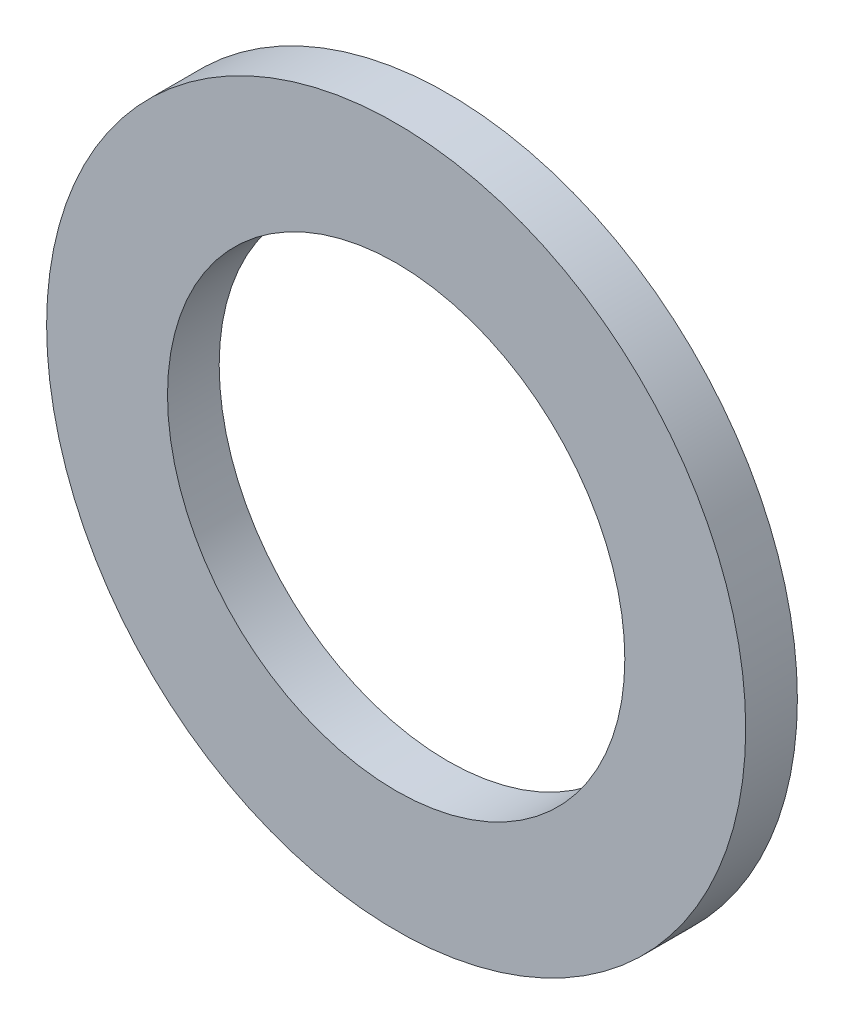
ISO-10303-21;
HEADER;
FILE_DESCRIPTION(('STEP AP214'),'2;1');
FILE_NAME('part.step','',(''),(''),'','','');
FILE_SCHEMA(('AUTOMOTIVE_DESIGN { 1 0 10303 214 1 1 1 1 }'));
ENDSEC;
DATA;
#1=APPLICATION_CONTEXT('core data for automotive mechanical design processes');
#2=APPLICATION_PROTOCOL_DEFINITION('international standard','automotive_design',2000,#1);
#3=PRODUCT_CONTEXT('',#1,'mechanical');
#4=PRODUCT('Part','Part','',(#3));
#5=PRODUCT_RELATED_PRODUCT_CATEGORY('part','',(#4));
#6=PRODUCT_DEFINITION_FORMATION('','',#4);
#7=PRODUCT_DEFINITION_CONTEXT('part definition',#1,'design');
#8=PRODUCT_DEFINITION('design','',#6,#7);
#9=PRODUCT_DEFINITION_SHAPE('','',#8);
#10=(LENGTH_UNIT() NAMED_UNIT(*) SI_UNIT(.MILLI.,.METRE.));
#11=(NAMED_UNIT(*) PLANE_ANGLE_UNIT() SI_UNIT($,.RADIAN.));
#12=(NAMED_UNIT(*) SI_UNIT($,.STERADIAN.) SOLID_ANGLE_UNIT());
#13=UNCERTAINTY_MEASURE_WITH_UNIT(LENGTH_MEASURE(1.E-05),#10,'distance_accuracy_value','');
#14=(GEOMETRIC_REPRESENTATION_CONTEXT(3) GLOBAL_UNCERTAINTY_ASSIGNED_CONTEXT((#13)) GLOBAL_UNIT_ASSIGNED_CONTEXT((#10,
#11,#12)) REPRESENTATION_CONTEXT('',''));
#15=CARTESIAN_POINT('',(0.,0.,0.));
#16=DIRECTION('',(0.,0.,1.));
#17=DIRECTION('',(1.,0.,0.));
#18=AXIS2_PLACEMENT_3D('',#15,#16,#17);
#19=CARTESIAN_POINT('',(9.46847857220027,-4.90502847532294,1.524));
#20=DIRECTION('',(0.,0.,1.));
#21=DIRECTION('',(1.,0.,0.));
#22=AXIS2_PLACEMENT_3D('',#19,#20,#21);
#23=PLANE('',#22);
#24=CARTESIAN_POINT('',(9.46847857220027,-4.90502847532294,1.524));
#25=DIRECTION('',(0.,0.,1.));
#26=DIRECTION('',(1.,0.,0.));
#27=AXIS2_PLACEMENT_3D('',#24,#25,#26);
#28=CIRCLE('',#27,10.3089848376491);
#29=CARTESIAN_POINT('',(-0.840506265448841,-4.90502847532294,1.524));
#30=VERTEX_POINT('',#29);
#31=EDGE_CURVE('E10',#30,#30,#28,.T.);
#32=ORIENTED_EDGE('',*,*,#31,.T.);
#33=EDGE_LOOP('',(#32));
#34=FACE_BOUND('',#33,.T.);
#35=CARTESIAN_POINT('',(9.46847857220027,-4.90502847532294,1.524));
#36=DIRECTION('',(0.,0.,1.));
#37=DIRECTION('',(1.,0.,0.));
#38=AXIS2_PLACEMENT_3D('',#35,#36,#37);
#39=CIRCLE('',#38,6.7437);
#40=CARTESIAN_POINT('',(2.72477857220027,-4.90502847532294,1.524));
#41=VERTEX_POINT('',#40);
#42=EDGE_CURVE('E43',#41,#41,#39,.T.);
#43=ORIENTED_EDGE('',*,*,#42,.F.);
#44=EDGE_LOOP('',(#43));
#45=FACE_BOUND('',#44,.T.);
#46=ADVANCED_FACE('F32',(#34,#45),#23,.T.);
#47=CARTESIAN_POINT('',(9.46847857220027,-4.90502847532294,0.));
#48=DIRECTION('',(0.,0.,1.));
#49=DIRECTION('',(1.,0.,0.));
#50=AXIS2_PLACEMENT_3D('',#47,#48,#49);
#51=PLANE('',#50);
#52=CARTESIAN_POINT('',(9.46847857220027,-4.90502847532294,0.));
#53=DIRECTION('',(0.,0.,1.));
#54=DIRECTION('',(1.,0.,0.));
#55=AXIS2_PLACEMENT_3D('',#52,#53,#54);
#56=CIRCLE('',#55,10.3089848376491);
#57=CARTESIAN_POINT('',(-0.840506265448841,-4.90502847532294,0.));
#58=VERTEX_POINT('',#57);
#59=EDGE_CURVE('E36',#58,#58,#56,.T.);
#60=ORIENTED_EDGE('',*,*,#59,.F.);
#61=EDGE_LOOP('',(#60));
#62=FACE_BOUND('',#61,.T.);
#63=CARTESIAN_POINT('',(9.46847857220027,-4.90502847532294,0.));
#64=DIRECTION('',(0.,0.,1.));
#65=DIRECTION('',(1.,0.,0.));
#66=AXIS2_PLACEMENT_3D('',#63,#64,#65);
#67=CIRCLE('',#66,6.7437);
#68=CARTESIAN_POINT('',(2.72477857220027,-4.90502847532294,0.));
#69=VERTEX_POINT('',#68);
#70=EDGE_CURVE('E45',#69,#69,#67,.T.);
#71=ORIENTED_EDGE('',*,*,#70,.T.);
#72=EDGE_LOOP('',(#71));
#73=FACE_BOUND('',#72,.T.);
#74=ADVANCED_FACE('F55',(#62,#73),#51,.F.);
#75=CARTESIAN_POINT('',(9.46847857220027,-4.90502847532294,1.524));
#76=DIRECTION('',(0.,0.,-1.));
#77=DIRECTION('',(-1.,0.,0.));
#78=AXIS2_PLACEMENT_3D('',#75,#76,#77);
#79=CYLINDRICAL_SURFACE('',#78,10.3089848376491);
#80=CARTESIAN_POINT('',(-0.840506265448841,-4.90502847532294,1.524));
#81=CARTESIAN_POINT('',(-0.840506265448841,-4.90502847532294,1.508125));
#82=CARTESIAN_POINT('',(-0.840506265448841,-4.90502847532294,1.49225));
#83=CARTESIAN_POINT('',(-0.840506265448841,-4.90502847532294,1.4605));
#84=CARTESIAN_POINT('',(-0.840506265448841,-4.90502847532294,1.444625));
#85=CARTESIAN_POINT('',(-0.840506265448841,-4.90502847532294,1.412875));
#86=CARTESIAN_POINT('',(-0.840506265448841,-4.90502847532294,1.397));
#87=CARTESIAN_POINT('',(-0.840506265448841,-4.90502847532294,1.36525));
#88=CARTESIAN_POINT('',(-0.840506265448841,-4.90502847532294,1.349375));
#89=CARTESIAN_POINT('',(-0.840506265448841,-4.90502847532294,1.317625));
#90=CARTESIAN_POINT('',(-0.840506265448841,-4.90502847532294,1.30175));
#91=CARTESIAN_POINT('',(-0.840506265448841,-4.90502847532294,1.27));
#92=CARTESIAN_POINT('',(-0.840506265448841,-4.90502847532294,1.254125));
#93=CARTESIAN_POINT('',(-0.840506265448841,-4.90502847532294,1.222375));
#94=CARTESIAN_POINT('',(-0.840506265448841,-4.90502847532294,1.2065));
#95=CARTESIAN_POINT('',(-0.840506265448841,-4.90502847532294,1.17475));
#96=CARTESIAN_POINT('',(-0.840506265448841,-4.90502847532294,1.158875));
#97=CARTESIAN_POINT('',(-0.840506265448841,-4.90502847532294,1.127125));
#98=CARTESIAN_POINT('',(-0.840506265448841,-4.90502847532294,1.11125));
#99=CARTESIAN_POINT('',(-0.840506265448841,-4.90502847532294,1.0795));
#100=CARTESIAN_POINT('',(-0.840506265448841,-4.90502847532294,1.063625));
#101=CARTESIAN_POINT('',(-0.840506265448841,-4.90502847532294,1.031875));
#102=CARTESIAN_POINT('',(-0.840506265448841,-4.90502847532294,1.016));
#103=CARTESIAN_POINT('',(-0.840506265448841,-4.90502847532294,0.98425));
#104=CARTESIAN_POINT('',(-0.840506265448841,-4.90502847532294,0.968375));
#105=CARTESIAN_POINT('',(-0.840506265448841,-4.90502847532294,0.936625));
#106=CARTESIAN_POINT('',(-0.840506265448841,-4.90502847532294,0.92075));
#107=CARTESIAN_POINT('',(-0.840506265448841,-4.90502847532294,0.889));
#108=CARTESIAN_POINT('',(-0.840506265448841,-4.90502847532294,0.873125));
#109=CARTESIAN_POINT('',(-0.840506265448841,-4.90502847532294,0.841375));
#110=CARTESIAN_POINT('',(-0.840506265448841,-4.90502847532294,0.8255));
#111=CARTESIAN_POINT('',(-0.840506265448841,-4.90502847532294,0.79375));
#112=CARTESIAN_POINT('',(-0.840506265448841,-4.90502847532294,0.777875));
#113=CARTESIAN_POINT('',(-0.840506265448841,-4.90502847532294,0.746125));
#114=CARTESIAN_POINT('',(-0.840506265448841,-4.90502847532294,0.73025));
#115=CARTESIAN_POINT('',(-0.840506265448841,-4.90502847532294,0.6985));
#116=CARTESIAN_POINT('',(-0.840506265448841,-4.90502847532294,0.682625));
#117=CARTESIAN_POINT('',(-0.840506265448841,-4.90502847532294,0.650875));
#118=CARTESIAN_POINT('',(-0.840506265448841,-4.90502847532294,0.635));
#119=CARTESIAN_POINT('',(-0.840506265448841,-4.90502847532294,0.60325));
#120=CARTESIAN_POINT('',(-0.840506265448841,-4.90502847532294,0.587375));
#121=CARTESIAN_POINT('',(-0.840506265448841,-4.90502847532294,0.555625));
#122=CARTESIAN_POINT('',(-0.840506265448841,-4.90502847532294,0.53975));
#123=CARTESIAN_POINT('',(-0.840506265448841,-4.90502847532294,0.508));
#124=CARTESIAN_POINT('',(-0.840506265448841,-4.90502847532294,0.492125));
#125=CARTESIAN_POINT('',(-0.840506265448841,-4.90502847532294,0.460375));
#126=CARTESIAN_POINT('',(-0.840506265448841,-4.90502847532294,0.4445));
#127=CARTESIAN_POINT('',(-0.840506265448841,-4.90502847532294,0.41275));
#128=CARTESIAN_POINT('',(-0.840506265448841,-4.90502847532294,0.396875));
#129=CARTESIAN_POINT('',(-0.840506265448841,-4.90502847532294,0.365125));
#130=CARTESIAN_POINT('',(-0.840506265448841,-4.90502847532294,0.34925));
#131=CARTESIAN_POINT('',(-0.840506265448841,-4.90502847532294,0.3175));
#132=CARTESIAN_POINT('',(-0.840506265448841,-4.90502847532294,0.301625));
#133=CARTESIAN_POINT('',(-0.840506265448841,-4.90502847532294,0.269875));
#134=CARTESIAN_POINT('',(-0.840506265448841,-4.90502847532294,0.254));
#135=CARTESIAN_POINT('',(-0.840506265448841,-4.90502847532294,0.22225));
#136=CARTESIAN_POINT('',(-0.840506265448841,-4.90502847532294,0.206375));
#137=CARTESIAN_POINT('',(-0.840506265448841,-4.90502847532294,0.174625));
#138=CARTESIAN_POINT('',(-0.840506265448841,-4.90502847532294,0.15875));
#139=CARTESIAN_POINT('',(-0.840506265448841,-4.90502847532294,0.127));
#140=CARTESIAN_POINT('',(-0.840506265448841,-4.90502847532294,0.111125));
#141=CARTESIAN_POINT('',(-0.840506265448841,-4.90502847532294,0.079375));
#142=CARTESIAN_POINT('',(-0.840506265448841,-4.90502847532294,0.0635));
#143=CARTESIAN_POINT('',(-0.840506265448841,-4.90502847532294,0.0317499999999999));
#144=CARTESIAN_POINT('',(-0.840506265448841,-4.90502847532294,0.015875));
#145=CARTESIAN_POINT('',(-0.840506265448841,-4.90502847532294,0.));
#146=B_SPLINE_CURVE_WITH_KNOTS('',3,(#80,#81,#82,#83,#84,#85,#86,#87,#88,#89,#90,#91,#92,#93,
#94,#95,#96,#97,#98,#99,#100,#101,#102,#103,#104,#105,#106,#107,#108,#109,#110,#111,#112,#113,
#114,#115,#116,#117,#118,#119,#120,#121,#122,#123,#124,#125,#126,#127,#128,#129,#130,#131,#132,
#133,#134,#135,#136,#137,#138,#139,#140,#141,#142,#143,#144,#145),.UNSPECIFIED.,.F.,.F.,(4,2,2,
2,2,2,2,2,2,2,2,2,2,2,2,2,2,2,2,2,2,2,2,2,2,2,2,2,2,2,2,2,4),(0.,0.0476249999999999,
0.0952499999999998,0.142875,0.1905,0.238125,0.28575,0.333375,0.381,0.428625,0.47625,0.523875,
0.5715,0.619125,0.66675,0.714375,0.762,0.809625,0.85725,0.904875,0.9525,1.000125,1.04775,
1.095375,1.143,1.190625,1.23825,1.285875,1.3335,1.381125,1.42875,1.476375,1.524),.UNSPECIFIED.);
#147=EDGE_CURVE('BSEAM34',#30,#58,#146,.T.);
#148=ORIENTED_EDGE('',*,*,#31,.F.);
#149=ORIENTED_EDGE('',*,*,#59,.T.);
#150=ORIENTED_EDGE('',*,*,#147,.T.);
#151=ORIENTED_EDGE('',*,*,#147,.F.);
#152=EDGE_LOOP('',(#148,#150,#149,#151));
#153=FACE_BOUND('',#152,.T.);
#154=ADVANCED_FACE('F34',(#153),#79,.T.);
#155=CARTESIAN_POINT('',(9.46847857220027,-4.90502847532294,1.524));
#156=DIRECTION('',(0.,0.,-1.));
#157=DIRECTION('',(-1.,0.,0.));
#158=AXIS2_PLACEMENT_3D('',#155,#156,#157);
#159=CYLINDRICAL_SURFACE('',#158,6.7437);
#160=CARTESIAN_POINT('',(2.72477857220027,-4.90502847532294,1.524));
#161=CARTESIAN_POINT('',(2.72477857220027,-4.90502847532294,1.508125));
#162=CARTESIAN_POINT('',(2.72477857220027,-4.90502847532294,1.49225));
#163=CARTESIAN_POINT('',(2.72477857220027,-4.90502847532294,1.4605));
#164=CARTESIAN_POINT('',(2.72477857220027,-4.90502847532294,1.444625));
#165=CARTESIAN_POINT('',(2.72477857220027,-4.90502847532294,1.412875));
#166=CARTESIAN_POINT('',(2.72477857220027,-4.90502847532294,1.397));
#167=CARTESIAN_POINT('',(2.72477857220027,-4.90502847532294,1.36525));
#168=CARTESIAN_POINT('',(2.72477857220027,-4.90502847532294,1.349375));
#169=CARTESIAN_POINT('',(2.72477857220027,-4.90502847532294,1.317625));
#170=CARTESIAN_POINT('',(2.72477857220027,-4.90502847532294,1.30175));
#171=CARTESIAN_POINT('',(2.72477857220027,-4.90502847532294,1.27));
#172=CARTESIAN_POINT('',(2.72477857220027,-4.90502847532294,1.254125));
#173=CARTESIAN_POINT('',(2.72477857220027,-4.90502847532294,1.222375));
#174=CARTESIAN_POINT('',(2.72477857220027,-4.90502847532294,1.2065));
#175=CARTESIAN_POINT('',(2.72477857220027,-4.90502847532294,1.17475));
#176=CARTESIAN_POINT('',(2.72477857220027,-4.90502847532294,1.158875));
#177=CARTESIAN_POINT('',(2.72477857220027,-4.90502847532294,1.127125));
#178=CARTESIAN_POINT('',(2.72477857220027,-4.90502847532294,1.11125));
#179=CARTESIAN_POINT('',(2.72477857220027,-4.90502847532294,1.0795));
#180=CARTESIAN_POINT('',(2.72477857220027,-4.90502847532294,1.063625));
#181=CARTESIAN_POINT('',(2.72477857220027,-4.90502847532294,1.031875));
#182=CARTESIAN_POINT('',(2.72477857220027,-4.90502847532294,1.016));
#183=CARTESIAN_POINT('',(2.72477857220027,-4.90502847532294,0.98425));
#184=CARTESIAN_POINT('',(2.72477857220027,-4.90502847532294,0.968375));
#185=CARTESIAN_POINT('',(2.72477857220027,-4.90502847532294,0.936625));
#186=CARTESIAN_POINT('',(2.72477857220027,-4.90502847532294,0.92075));
#187=CARTESIAN_POINT('',(2.72477857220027,-4.90502847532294,0.889));
#188=CARTESIAN_POINT('',(2.72477857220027,-4.90502847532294,0.873125));
#189=CARTESIAN_POINT('',(2.72477857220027,-4.90502847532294,0.841375));
#190=CARTESIAN_POINT('',(2.72477857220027,-4.90502847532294,0.8255));
#191=CARTESIAN_POINT('',(2.72477857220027,-4.90502847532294,0.79375));
#192=CARTESIAN_POINT('',(2.72477857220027,-4.90502847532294,0.777875));
#193=CARTESIAN_POINT('',(2.72477857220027,-4.90502847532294,0.746125));
#194=CARTESIAN_POINT('',(2.72477857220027,-4.90502847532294,0.73025));
#195=CARTESIAN_POINT('',(2.72477857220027,-4.90502847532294,0.6985));
#196=CARTESIAN_POINT('',(2.72477857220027,-4.90502847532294,0.682625));
#197=CARTESIAN_POINT('',(2.72477857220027,-4.90502847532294,0.650875));
#198=CARTESIAN_POINT('',(2.72477857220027,-4.90502847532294,0.635));
#199=CARTESIAN_POINT('',(2.72477857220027,-4.90502847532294,0.60325));
#200=CARTESIAN_POINT('',(2.72477857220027,-4.90502847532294,0.587375));
#201=CARTESIAN_POINT('',(2.72477857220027,-4.90502847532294,0.555625));
#202=CARTESIAN_POINT('',(2.72477857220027,-4.90502847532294,0.53975));
#203=CARTESIAN_POINT('',(2.72477857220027,-4.90502847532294,0.508));
#204=CARTESIAN_POINT('',(2.72477857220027,-4.90502847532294,0.492125));
#205=CARTESIAN_POINT('',(2.72477857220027,-4.90502847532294,0.460375));
#206=CARTESIAN_POINT('',(2.72477857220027,-4.90502847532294,0.4445));
#207=CARTESIAN_POINT('',(2.72477857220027,-4.90502847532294,0.41275));
#208=CARTESIAN_POINT('',(2.72477857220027,-4.90502847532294,0.396875));
#209=CARTESIAN_POINT('',(2.72477857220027,-4.90502847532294,0.365125));
#210=CARTESIAN_POINT('',(2.72477857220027,-4.90502847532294,0.34925));
#211=CARTESIAN_POINT('',(2.72477857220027,-4.90502847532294,0.3175));
#212=CARTESIAN_POINT('',(2.72477857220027,-4.90502847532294,0.301625));
#213=CARTESIAN_POINT('',(2.72477857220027,-4.90502847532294,0.269875));
#214=CARTESIAN_POINT('',(2.72477857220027,-4.90502847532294,0.254));
#215=CARTESIAN_POINT('',(2.72477857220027,-4.90502847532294,0.22225));
#216=CARTESIAN_POINT('',(2.72477857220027,-4.90502847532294,0.206375));
#217=CARTESIAN_POINT('',(2.72477857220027,-4.90502847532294,0.174625));
#218=CARTESIAN_POINT('',(2.72477857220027,-4.90502847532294,0.15875));
#219=CARTESIAN_POINT('',(2.72477857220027,-4.90502847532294,0.127));
#220=CARTESIAN_POINT('',(2.72477857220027,-4.90502847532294,0.111125));
#221=CARTESIAN_POINT('',(2.72477857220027,-4.90502847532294,0.079375));
#222=CARTESIAN_POINT('',(2.72477857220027,-4.90502847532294,0.0635));
#223=CARTESIAN_POINT('',(2.72477857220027,-4.90502847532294,0.0317499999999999));
#224=CARTESIAN_POINT('',(2.72477857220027,-4.90502847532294,0.015875));
#225=CARTESIAN_POINT('',(2.72477857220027,-4.90502847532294,0.));
#226=B_SPLINE_CURVE_WITH_KNOTS('',3,(#160,#161,#162,#163,#164,#165,#166,#167,#168,#169,#170,
#171,#172,#173,#174,#175,#176,#177,#178,#179,#180,#181,#182,#183,#184,#185,#186,#187,#188,#189,
#190,#191,#192,#193,#194,#195,#196,#197,#198,#199,#200,#201,#202,#203,#204,#205,#206,#207,#208,
#209,#210,#211,#212,#213,#214,#215,#216,#217,#218,#219,#220,#221,#222,#223,#224,#225),
.UNSPECIFIED.,.F.,.F.,(4,2,2,2,2,2,2,2,2,2,2,2,2,2,2,2,2,2,2,2,2,2,2,2,2,2,2,2,2,2,2,2,4),(0.,
0.0476249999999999,0.0952499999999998,0.142875,0.1905,0.238125,0.28575,0.333375,0.381,0.428625,
0.47625,0.523875,0.5715,0.619125,0.66675,0.714375,0.762,0.809625,0.85725,0.904875,0.9525,
1.000125,1.04775,1.095375,1.143,1.190625,1.23825,1.285875,1.3335,1.381125,1.42875,1.476375,
1.524),.UNSPECIFIED.);
#227=EDGE_CURVE('BSEAM51',#41,#69,#226,.T.);
#228=ORIENTED_EDGE('',*,*,#42,.T.);
#229=ORIENTED_EDGE('',*,*,#70,.F.);
#230=ORIENTED_EDGE('',*,*,#227,.T.);
#231=ORIENTED_EDGE('',*,*,#227,.F.);
#232=EDGE_LOOP('',(#228,#230,#229,#231));
#233=FACE_BOUND('',#232,.T.);
#234=ADVANCED_FACE('F51',(#233),#159,.F.);
#235=CLOSED_SHELL('',(#46,#74,#154,#234));
#236=MANIFOLD_SOLID_BREP('B2',#235);
#237=ADVANCED_BREP_SHAPE_REPRESENTATION('',(#18,#236),#14);
#238=SHAPE_DEFINITION_REPRESENTATION(#9,#237);
ENDSEC;
END-ISO-10303-21;
